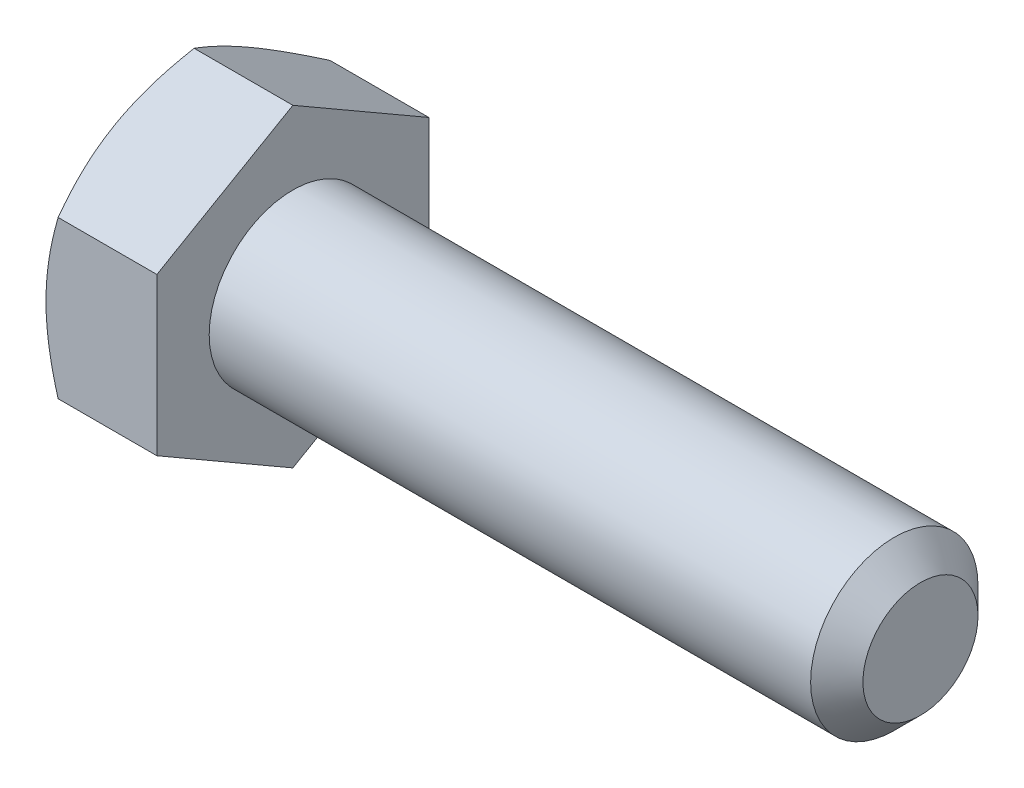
ISO-10303-21;
HEADER;
FILE_DESCRIPTION(('STEP AP214'),'2;1');
FILE_NAME('part.step','',(''),(''),'','','');
FILE_SCHEMA(('AUTOMOTIVE_DESIGN { 1 0 10303 214 1 1 1 1 }'));
ENDSEC;
DATA;
#1=APPLICATION_CONTEXT('core data for automotive mechanical design processes');
#2=APPLICATION_PROTOCOL_DEFINITION('international standard','automotive_design',2000,#1);
#3=PRODUCT_CONTEXT('',#1,'mechanical');
#4=PRODUCT('Part','Part','',(#3));
#5=PRODUCT_RELATED_PRODUCT_CATEGORY('part','',(#4));
#6=PRODUCT_DEFINITION_FORMATION('','',#4);
#7=PRODUCT_DEFINITION_CONTEXT('part definition',#1,'design');
#8=PRODUCT_DEFINITION('design','',#6,#7);
#9=PRODUCT_DEFINITION_SHAPE('','',#8);
#10=(LENGTH_UNIT() NAMED_UNIT(*) SI_UNIT(.MILLI.,.METRE.));
#11=(NAMED_UNIT(*) PLANE_ANGLE_UNIT() SI_UNIT($,.RADIAN.));
#12=(NAMED_UNIT(*) SI_UNIT($,.STERADIAN.) SOLID_ANGLE_UNIT());
#13=UNCERTAINTY_MEASURE_WITH_UNIT(LENGTH_MEASURE(1.E-05),#10,'distance_accuracy_value','');
#14=(GEOMETRIC_REPRESENTATION_CONTEXT(3) GLOBAL_UNCERTAINTY_ASSIGNED_CONTEXT((#13)) GLOBAL_UNIT_ASSIGNED_CONTEXT((#10,
#11,#12)) REPRESENTATION_CONTEXT('',''));
#15=CARTESIAN_POINT('',(0.,0.,0.));
#16=DIRECTION('',(0.,0.,1.));
#17=DIRECTION('',(1.,0.,0.));
#18=AXIS2_PLACEMENT_3D('',#15,#16,#17);
#19=CARTESIAN_POINT('',(30.,0.,0.));
#20=DIRECTION('',(-1.,0.,0.));
#21=DIRECTION('',(0.,0.,1.));
#22=AXIS2_PLACEMENT_3D('',#19,#20,#21);
#23=CYLINDRICAL_SURFACE('',#22,4.);
#24=CARTESIAN_POINT('',(28.75,0.,0.));
#25=DIRECTION('',(1.,0.,0.));
#26=DIRECTION('',(0.,0.,-1.));
#27=AXIS2_PLACEMENT_3D('',#24,#25,#26);
#28=CIRCLE('',#27,4.);
#29=CARTESIAN_POINT('',(28.75,0.,-4.));
#30=VERTEX_POINT('',#29);
#31=EDGE_CURVE('E11',#30,#30,#28,.F.);
#32=ORIENTED_EDGE('',*,*,#31,.T.);
#33=EDGE_LOOP('',(#32));
#34=FACE_BOUND('',#33,.T.);
#35=CARTESIAN_POINT('',(0.,0.,0.));
#36=DIRECTION('',(-1.,0.,0.));
#37=DIRECTION('',(0.,0.,1.));
#38=AXIS2_PLACEMENT_3D('',#35,#36,#37);
#39=CIRCLE('',#38,4.);
#40=CARTESIAN_POINT('',(0.,0.,4.));
#41=VERTEX_POINT('',#40);
#42=EDGE_CURVE('E537',#41,#41,#39,.T.);
#43=ORIENTED_EDGE('',*,*,#42,.F.);
#44=EDGE_LOOP('',(#43));
#45=FACE_BOUND('',#44,.T.);
#46=ADVANCED_FACE('F362',(#34,#45),#23,.T.);
#47=CARTESIAN_POINT('',(30.,0.,0.));
#48=DIRECTION('',(1.,0.,0.));
#49=DIRECTION('',(0.,0.,-1.));
#50=AXIS2_PLACEMENT_3D('',#47,#48,#49);
#51=PLANE('',#50);
#52=CARTESIAN_POINT('',(30.,0.,0.));
#53=DIRECTION('',(1.,0.,0.));
#54=DIRECTION('',(0.,0.,-1.));
#55=AXIS2_PLACEMENT_3D('',#52,#53,#54);
#56=CIRCLE('',#55,2.74999999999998);
#57=CARTESIAN_POINT('',(30.,0.,-2.74999999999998));
#58=VERTEX_POINT('',#57);
#59=EDGE_CURVE('E369',#58,#58,#56,.T.);
#60=ORIENTED_EDGE('',*,*,#59,.T.);
#61=EDGE_LOOP('',(#60));
#62=FACE_BOUND('',#61,.T.);
#63=ADVANCED_FACE('F522',(#62),#51,.T.);
#64=CARTESIAN_POINT('',(0.,-7.50555349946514,0.));
#65=DIRECTION('',(-1.,0.,0.));
#66=DIRECTION('',(0.,0.,1.));
#67=AXIS2_PLACEMENT_3D('',#64,#65,#66);
#68=PLANE('',#67);
#69=DIRECTION('',(0.,0.5,0.866025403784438));
#70=VECTOR('',#69,1.);
#71=CARTESIAN_POINT('',(0.,-7.50555349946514,0.));
#72=LINE('',#71,#70);
#73=CARTESIAN_POINT('',(0.,-7.50555349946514,0.));
#74=VERTEX_POINT('',#73);
#75=CARTESIAN_POINT('',(0.,-3.75277674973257,6.5));
#76=VERTEX_POINT('',#75);
#77=EDGE_CURVE('E564',#74,#76,#72,.T.);
#78=ORIENTED_EDGE('',*,*,#77,.F.);
#79=DIRECTION('',(0.,0.5,-0.866025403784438));
#80=VECTOR('',#79,1.);
#81=CARTESIAN_POINT('',(0.,-7.50555349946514,0.));
#82=LINE('',#81,#80);
#83=CARTESIAN_POINT('',(0.,-3.75277674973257,-6.5));
#84=VERTEX_POINT('',#83);
#85=EDGE_CURVE('E551',#74,#84,#82,.T.);
#86=ORIENTED_EDGE('',*,*,#85,.T.);
#87=DIRECTION('',(0.,1.,0.));
#88=VECTOR('',#87,1.);
#89=CARTESIAN_POINT('',(0.,-3.75277674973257,-6.5));
#90=LINE('',#89,#88);
#91=CARTESIAN_POINT('',(0.,3.75277674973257,-6.5));
#92=VERTEX_POINT('',#91);
#93=EDGE_CURVE('E554',#84,#92,#90,.T.);
#94=ORIENTED_EDGE('',*,*,#93,.T.);
#95=DIRECTION('',(0.,0.5,0.866025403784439));
#96=VECTOR('',#95,1.);
#97=CARTESIAN_POINT('',(0.,3.75277674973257,-6.5));
#98=LINE('',#97,#96);
#99=CARTESIAN_POINT('',(0.,7.50555349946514,0.));
#100=VERTEX_POINT('',#99);
#101=EDGE_CURVE('E557',#92,#100,#98,.T.);
#102=ORIENTED_EDGE('',*,*,#101,.T.);
#103=DIRECTION('',(0.,0.5,-0.866025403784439));
#104=VECTOR('',#103,1.);
#105=CARTESIAN_POINT('',(0.,3.75277674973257,6.5));
#106=LINE('',#105,#104);
#107=CARTESIAN_POINT('',(0.,3.75277674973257,6.5));
#108=VERTEX_POINT('',#107);
#109=EDGE_CURVE('E560',#108,#100,#106,.T.);
#110=ORIENTED_EDGE('',*,*,#109,.F.);
#111=DIRECTION('',(0.,1.,0.));
#112=VECTOR('',#111,1.);
#113=CARTESIAN_POINT('',(0.,-3.75277674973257,6.5));
#114=LINE('',#113,#112);
#115=EDGE_CURVE('E562',#76,#108,#114,.T.);
#116=ORIENTED_EDGE('',*,*,#115,.F.);
#117=EDGE_LOOP('',(#78,#86,#94,#102,#110,#116));
#118=FACE_BOUND('',#117,.T.);
#119=ORIENTED_EDGE('',*,*,#42,.T.);
#120=EDGE_LOOP('',(#119));
#121=FACE_BOUND('',#120,.T.);
#122=ADVANCED_FACE('F493',(#118,#121),#68,.F.);
#123=CARTESIAN_POINT('',(-5.3,-7.50555349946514,0.));
#124=DIRECTION('',(0.,0.866025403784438,-0.5));
#125=DIRECTION('',(0.,0.5,0.866025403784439));
#126=AXIS2_PLACEMENT_3D('',#123,#124,#125);
#127=PLANE('',#126);
#128=CARTESIAN_POINT('',(-4.71937674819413,-7.50566896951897,-0.000200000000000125));
#129=CARTESIAN_POINT('',(-4.76699557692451,-7.4231786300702,0.142677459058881));
#130=CARTESIAN_POINT('',(-4.81245329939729,-7.34038072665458,0.286087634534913));
#131=CARTESIAN_POINT('',(-4.89845131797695,-7.17411251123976,0.574072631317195));
#132=CARTESIAN_POINT('',(-4.93898949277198,-7.09064192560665,0.718647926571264));
#133=CARTESIAN_POINT('',(-5.05242899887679,-6.83889369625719,1.15468865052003));
#134=CARTESIAN_POINT('',(-5.11695219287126,-6.66962231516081,1.44787528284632));
#135=CARTESIAN_POINT('',(-5.19261341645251,-6.41631077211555,1.88662374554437));
#136=CARTESIAN_POINT('',(-5.21416714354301,-6.33302748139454,2.03087463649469));
#137=CARTESIAN_POINT('',(-5.25030968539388,-6.16608458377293,2.32002821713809));
#138=CARTESIAN_POINT('',(-5.26489911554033,-6.08242501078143,2.46493084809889));
#139=CARTESIAN_POINT('',(-5.28674124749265,-5.91496056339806,2.75498777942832));
#140=CARTESIAN_POINT('',(-5.29400227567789,-5.8311559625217,2.90014160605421));
#141=CARTESIAN_POINT('',(-5.30103969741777,-5.66347396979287,3.19057533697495));
#142=CARTESIAN_POINT('',(-5.3008163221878,-5.5795965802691,3.33585523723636));
#143=CARTESIAN_POINT('',(-5.28991654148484,-5.34979921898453,3.73387594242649));
#144=CARTESIAN_POINT('',(-5.27161818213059,-5.20395446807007,3.98648646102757));
#145=CARTESIAN_POINT('',(-5.21359365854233,-4.91323365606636,4.49002967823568));
#146=CARTESIAN_POINT('',(-5.17384766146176,-4.76835861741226,4.74096060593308));
#147=CARTESIAN_POINT('',(-5.07449409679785,-4.47705272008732,5.24551722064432));
#148=CARTESIAN_POINT('',(-5.01446557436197,-4.33065861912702,5.49907924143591));
#149=CARTESIAN_POINT('',(-4.87822500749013,-4.04005357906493,6.00242193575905));
#150=CARTESIAN_POINT('',(-4.80204496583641,-3.89583891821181,6.25220905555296));
#151=CARTESIAN_POINT('',(-4.71937674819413,-3.75266127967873,6.5002));
#152=B_SPLINE_CURVE_WITH_KNOTS('',3,(#128,#129,#130,#131,#132,#133,#134,#135,#136,#137,#138,
#139,#140,#141,#142,#143,#144,#145,#146,#147,#148,#149,#150,#151),.UNSPECIFIED.,.F.,.F.,(4,2,2,
2,2,2,2,2,2,2,2,4),(0.,0.515105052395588,1.03043143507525,2.06322554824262,2.56697389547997,
3.07067772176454,3.57380860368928,4.0769239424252,4.9527935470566,5.82947446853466,
6.72559912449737,7.61996451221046),.UNSPECIFIED.);
#153=CARTESIAN_POINT('',(-4.71944341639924,-7.50555349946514,0.));
#154=VERTEX_POINT('',#153);
#155=CARTESIAN_POINT('',(-5.3,-5.62916512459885,3.25));
#156=VERTEX_POINT('',#155);
#157=EDGE_CURVE('E510',#154,#156,#152,.T.);
#158=ORIENTED_EDGE('',*,*,#157,.F.);
#159=DIRECTION('',(1.,0.,0.));
#160=VECTOR('',#159,1.);
#161=CARTESIAN_POINT('',(-5.3,-7.50555349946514,0.));
#162=LINE('',#161,#160);
#163=EDGE_CURVE('E549',#154,#74,#162,.T.);
#164=ORIENTED_EDGE('',*,*,#163,.T.);
#165=ORIENTED_EDGE('',*,*,#77,.T.);
#166=DIRECTION('',(1.,0.,0.));
#167=VECTOR('',#166,1.);
#168=CARTESIAN_POINT('',(-5.3,-3.75277674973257,6.5));
#169=LINE('',#168,#167);
#170=CARTESIAN_POINT('',(-4.71944341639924,-3.75277674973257,6.5));
#171=VERTEX_POINT('',#170);
#172=EDGE_CURVE('E540',#171,#76,#169,.T.);
#173=ORIENTED_EDGE('',*,*,#172,.F.);
#174=EDGE_CURVE('E464',#156,#171,#152,.T.);
#175=ORIENTED_EDGE('',*,*,#174,.F.);
#176=EDGE_LOOP('',(#158,#164,#165,#173,#175));
#177=FACE_BOUND('',#176,.T.);
#178=ADVANCED_FACE('F516',(#177),#127,.F.);
#179=CARTESIAN_POINT('',(-5.3,-3.75277674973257,6.5));
#180=DIRECTION('',(0.,0.,-1.));
#181=DIRECTION('',(-1.,0.,0.));
#182=AXIS2_PLACEMENT_3D('',#179,#180,#181);
#183=PLANE('',#182);
#184=CARTESIAN_POINT('',(-2.0488375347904,-10.2428264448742,6.5));
#185=CARTESIAN_POINT('',(-2.18789595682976,-9.95749123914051,6.5));
#186=CARTESIAN_POINT('',(-2.32566707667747,-9.67151814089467,6.5));
#187=CARTESIAN_POINT('',(-2.59791370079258,-9.09795746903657,6.5));
#188=CARTESIAN_POINT('',(-2.73238871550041,-8.81036966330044,6.5));
#189=CARTESIAN_POINT('',(-2.99796413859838,-8.23183597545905,6.5));
#190=CARTESIAN_POINT('',(-3.12904355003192,-7.94088042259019,6.5));
#191=CARTESIAN_POINT('',(-3.38604980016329,-7.35671087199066,6.5));
#192=CARTESIAN_POINT('',(-3.51197687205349,-7.06349697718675,6.5));
#193=CARTESIAN_POINT('',(-3.76148583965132,-6.4643492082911,6.5));
#194=CARTESIAN_POINT('',(-3.88484316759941,-6.15832132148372,6.5));
#195=CARTESIAN_POINT('',(-4.122608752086,-5.54274557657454,6.5));
#196=CARTESIAN_POINT('',(-4.23701602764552,-5.23319733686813,6.5));
#197=CARTESIAN_POINT('',(-4.45399730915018,-4.61061796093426,6.5));
#198=CARTESIAN_POINT('',(-4.55659391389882,-4.29759477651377,6.5));
#199=CARTESIAN_POINT('',(-4.7467687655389,-3.66705774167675,6.5));
#200=CARTESIAN_POINT('',(-4.83435157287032,-3.34954528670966,6.5));
#201=CARTESIAN_POINT('',(-4.98994277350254,-2.7116231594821,6.5));
#202=CARTESIAN_POINT('',(-5.05806094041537,-2.39124068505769,6.5));
#203=CARTESIAN_POINT('',(-5.17096432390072,-1.74628166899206,6.5));
#204=CARTESIAN_POINT('',(-5.21575208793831,-1.42170558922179,6.5));
#205=CARTESIAN_POINT('',(-5.26247031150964,-0.935153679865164,6.5));
#206=CARTESIAN_POINT('',(-5.27461755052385,-0.774120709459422,6.5));
#207=CARTESIAN_POINT('',(-5.29209027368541,-0.451677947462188,6.5));
#208=CARTESIAN_POINT('',(-5.29741587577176,-0.290268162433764,6.5));
#209=CARTESIAN_POINT('',(-5.30111032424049,0.0326315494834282,6.5));
#210=CARTESIAN_POINT('',(-5.29947913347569,0.194121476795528,6.5));
#211=CARTESIAN_POINT('',(-5.28930353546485,0.516885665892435,6.5));
#212=CARTESIAN_POINT('',(-5.2807588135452,0.678159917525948,6.5));
#213=CARTESIAN_POINT('',(-5.2524625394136,1.06087214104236,6.5));
#214=CARTESIAN_POINT('',(-5.22970222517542,1.28209274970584,6.5));
#215=CARTESIAN_POINT('',(-5.17237790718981,1.72298724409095,6.5));
#216=CARTESIAN_POINT('',(-5.13781243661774,1.94266093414,6.5));
#217=CARTESIAN_POINT('',(-5.01823337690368,2.59905068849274,6.5));
#218=CARTESIAN_POINT('',(-4.91735524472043,3.03292018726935,6.5));
#219=CARTESIAN_POINT('',(-4.74117763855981,3.68203059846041,6.5));
#220=CARTESIAN_POINT('',(-4.67743243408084,3.90060192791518,6.5));
#221=CARTESIAN_POINT('',(-4.54301317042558,4.33562456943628,6.5));
#222=CARTESIAN_POINT('',(-4.47233905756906,4.55207586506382,6.5));
#223=CARTESIAN_POINT('',(-4.32522134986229,4.9829231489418,6.5));
#224=CARTESIAN_POINT('',(-4.24877936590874,5.19731969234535,6.5));
#225=CARTESIAN_POINT('',(-4.09105605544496,5.62431367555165,6.5));
#226=CARTESIAN_POINT('',(-4.00977484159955,5.83691115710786,6.5));
#227=CARTESIAN_POINT('',(-3.78396124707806,6.41107024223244,6.5));
#228=CARTESIAN_POINT('',(-3.63553740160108,6.7710999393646,6.5));
#229=CARTESIAN_POINT('',(-3.3299136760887,7.4874289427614,6.5));
#230=CARTESIAN_POINT('',(-3.17271280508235,7.84372782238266,6.5));
#231=CARTESIAN_POINT('',(-2.8516207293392,8.55345570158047,6.5));
#232=CARTESIAN_POINT('',(-2.68772693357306,8.90688352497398,6.5));
#233=CARTESIAN_POINT('',(-2.35485675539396,9.61131133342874,6.5));
#234=CARTESIAN_POINT('',(-2.18588058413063,9.96231141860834,6.5));
#235=CARTESIAN_POINT('',(-1.84367823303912,10.662937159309,6.5));
#236=CARTESIAN_POINT('',(-1.67044558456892,11.012559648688,6.5));
#237=CARTESIAN_POINT('',(-1.32082260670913,11.7102232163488,6.5));
#238=CARTESIAN_POINT('',(-1.14443225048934,12.0582642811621,6.5));
#239=CARTESIAN_POINT('',(-0.78915631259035,12.7529700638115,6.5));
#240=CARTESIAN_POINT('',(-0.610271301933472,13.099635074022,6.5));
#241=CARTESIAN_POINT('',(-0.250435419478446,13.7918918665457,6.5));
#242=CARTESIAN_POINT('',(-0.0694845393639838,14.1374836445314,6.5));
#243=CARTESIAN_POINT('',(0.437179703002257,15.099399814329,6.5));
#244=CARTESIAN_POINT('',(0.7647482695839,15.7147468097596,6.5));
#245=CARTESIAN_POINT('',(1.4238123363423,16.9433793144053,6.5));
#246=CARTESIAN_POINT('',(1.75530808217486,17.5566646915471,6.5));
#247=CARTESIAN_POINT('',(2.42008717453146,18.779571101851,6.5));
#248=CARTESIAN_POINT('',(2.75336064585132,19.3891975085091,6.5));
#249=CARTESIAN_POINT('',(3.4221398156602,20.6071616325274,6.5));
#250=CARTESIAN_POINT('',(3.75764533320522,21.2154994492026,6.5));
#251=CARTESIAN_POINT('',(4.0939612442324,21.8233856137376,6.5));
#252=B_SPLINE_CURVE_WITH_KNOTS('',3,(#184,#185,#186,#187,#188,#189,#190,#191,#192,#193,#194,
#195,#196,#197,#198,#199,#200,#201,#202,#203,#204,#205,#206,#207,#208,#209,#210,#211,#212,#213,
#214,#215,#216,#217,#218,#219,#220,#221,#222,#223,#224,#225,#226,#227,#228,#229,#230,#231,#232,
#233,#234,#235,#236,#237,#238,#239,#240,#241,#242,#243,#244,#245,#246,#247,#248,#249,#250,#251),
.UNSPECIFIED.,.F.,.F.,(4,2,2,2,2,2,2,2,2,2,2,2,2,2,2,2,2,2,2,2,2,2,2,2,2,2,2,2,2,2,2,2,2,4),(0.,
0.952261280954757,1.90466315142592,2.86198011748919,3.81925370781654,4.80900961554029,
5.79887385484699,6.78681142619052,7.77444837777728,8.75640022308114,9.73824482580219,
10.2225937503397,10.7069343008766,11.1912774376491,11.6756426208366,12.3424346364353,
13.0093095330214,14.3437044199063,15.0266742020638,15.7096492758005,16.3924343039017,
17.0752034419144,18.2433007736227,19.4115302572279,20.580216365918,21.7488539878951,
22.9193933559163,24.0899426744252,25.2602283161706,26.4305186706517,28.5218066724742,
30.6132261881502,32.6975528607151,34.7817125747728),.UNSPECIFIED.);
#253=CARTESIAN_POINT('',(-5.3,0.,6.5));
#254=VERTEX_POINT('',#253);
#255=EDGE_CURVE('E566',#171,#254,#252,.T.);
#256=ORIENTED_EDGE('',*,*,#255,.F.);
#257=ORIENTED_EDGE('',*,*,#172,.T.);
#258=ORIENTED_EDGE('',*,*,#115,.T.);
#259=DIRECTION('',(1.,0.,0.));
#260=VECTOR('',#259,1.);
#261=CARTESIAN_POINT('',(-5.3,3.75277674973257,6.5));
#262=LINE('',#261,#260);
#263=CARTESIAN_POINT('',(-4.71944341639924,3.75277674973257,6.5));
#264=VERTEX_POINT('',#263);
#265=EDGE_CURVE('E542',#264,#108,#262,.T.);
#266=ORIENTED_EDGE('',*,*,#265,.F.);
#267=EDGE_CURVE('E435',#254,#264,#252,.T.);
#268=ORIENTED_EDGE('',*,*,#267,.F.);
#269=EDGE_LOOP('',(#256,#257,#258,#266,#268));
#270=FACE_BOUND('',#269,.T.);
#271=ADVANCED_FACE('F519',(#270),#183,.F.);
#272=CARTESIAN_POINT('',(-5.3,3.75277674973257,6.5));
#273=DIRECTION('',(0.,-0.866025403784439,-0.5));
#274=DIRECTION('',(0.,0.5,-0.866025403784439));
#275=AXIS2_PLACEMENT_3D('',#272,#273,#274);
#276=PLANE('',#275);
#277=CARTESIAN_POINT('',(-4.71937674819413,3.75266127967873,6.5002));
#278=CARTESIAN_POINT('',(-4.76699557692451,3.83515161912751,6.35732254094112));
#279=CARTESIAN_POINT('',(-4.81245329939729,3.91794952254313,6.21391236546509));
#280=CARTESIAN_POINT('',(-4.89845131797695,4.08421773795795,5.9259273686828));
#281=CARTESIAN_POINT('',(-4.93898949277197,4.16768832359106,5.78135207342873));
#282=CARTESIAN_POINT('',(-5.05242899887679,4.41943655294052,5.34531134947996));
#283=CARTESIAN_POINT('',(-5.11695219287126,4.5887079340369,5.05212471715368));
#284=CARTESIAN_POINT('',(-5.19261341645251,4.84201947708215,4.61337625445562));
#285=CARTESIAN_POINT('',(-5.21416714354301,4.92530276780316,4.46912536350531));
#286=CARTESIAN_POINT('',(-5.25030968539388,5.09224566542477,4.17997178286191));
#287=CARTESIAN_POINT('',(-5.26489911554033,5.17590523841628,4.03506915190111));
#288=CARTESIAN_POINT('',(-5.28674124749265,5.34336968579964,3.74501222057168));
#289=CARTESIAN_POINT('',(-5.29400227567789,5.427174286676,3.59985839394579));
#290=CARTESIAN_POINT('',(-5.30103969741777,5.59485627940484,3.30942466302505));
#291=CARTESIAN_POINT('',(-5.30081632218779,5.6787336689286,3.16414476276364));
#292=CARTESIAN_POINT('',(-5.28991654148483,5.90853103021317,2.7661240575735));
#293=CARTESIAN_POINT('',(-5.27161818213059,6.05437578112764,2.51351353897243));
#294=CARTESIAN_POINT('',(-5.21359365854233,6.34509659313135,2.00997032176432));
#295=CARTESIAN_POINT('',(-5.17384766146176,6.48997163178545,1.75903939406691));
#296=CARTESIAN_POINT('',(-5.07449409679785,6.78127752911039,1.25448277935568));
#297=CARTESIAN_POINT('',(-5.01446557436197,6.92767163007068,1.00092075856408));
#298=CARTESIAN_POINT('',(-4.87822500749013,7.21827667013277,0.497578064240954));
#299=CARTESIAN_POINT('',(-4.80204496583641,7.36249133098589,0.247790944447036));
#300=CARTESIAN_POINT('',(-4.71937674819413,7.50566896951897,-0.000199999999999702));
#301=B_SPLINE_CURVE_WITH_KNOTS('',3,(#277,#278,#279,#280,#281,#282,#283,#284,#285,#286,#287,
#288,#289,#290,#291,#292,#293,#294,#295,#296,#297,#298,#299,#300),.UNSPECIFIED.,.F.,.F.,(4,2,2,
2,2,2,2,2,2,2,2,4),(0.,0.515105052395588,1.03043143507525,2.06322554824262,2.56697389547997,
3.07067772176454,3.57380860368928,4.0769239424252,4.9527935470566,5.82947446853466,
6.72559912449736,7.61996451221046),.UNSPECIFIED.);
#302=CARTESIAN_POINT('',(-5.3,5.62916512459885,3.25));
#303=VERTEX_POINT('',#302);
#304=EDGE_CURVE('E431',#264,#303,#301,.T.);
#305=ORIENTED_EDGE('',*,*,#304,.F.);
#306=ORIENTED_EDGE('',*,*,#265,.T.);
#307=ORIENTED_EDGE('',*,*,#109,.T.);
#308=DIRECTION('',(1.,0.,0.));
#309=VECTOR('',#308,1.);
#310=CARTESIAN_POINT('',(-5.3,7.50555349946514,0.));
#311=LINE('',#310,#309);
#312=CARTESIAN_POINT('',(-4.71944341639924,7.50555349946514,0.));
#313=VERTEX_POINT('',#312);
#314=EDGE_CURVE('E463',#313,#100,#311,.T.);
#315=ORIENTED_EDGE('',*,*,#314,.F.);
#316=EDGE_CURVE('E439',#303,#313,#301,.T.);
#317=ORIENTED_EDGE('',*,*,#316,.F.);
#318=EDGE_LOOP('',(#305,#306,#307,#315,#317));
#319=FACE_BOUND('',#318,.T.);
#320=ADVANCED_FACE('F461',(#319),#276,.F.);
#321=CARTESIAN_POINT('',(-5.3,3.75277674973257,-6.5));
#322=DIRECTION('',(0.,0.866025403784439,-0.5));
#323=DIRECTION('',(0.,0.5,0.866025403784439));
#324=AXIS2_PLACEMENT_3D('',#321,#322,#323);
#325=PLANE('',#324);
#326=DIRECTION('',(1.,0.,0.));
#327=VECTOR('',#326,1.);
#328=CARTESIAN_POINT('',(-5.3,3.75277674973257,-6.5));
#329=LINE('',#328,#327);
#330=CARTESIAN_POINT('',(-4.71944341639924,3.75277674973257,-6.5));
#331=VERTEX_POINT('',#330);
#332=EDGE_CURVE('E545',#331,#92,#329,.T.);
#333=ORIENTED_EDGE('',*,*,#332,.F.);
#334=CARTESIAN_POINT('',(-4.71937674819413,3.75266127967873,-6.5002));
#335=CARTESIAN_POINT('',(-4.76699557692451,3.83515161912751,-6.35732254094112));
#336=CARTESIAN_POINT('',(-4.81245329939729,3.91794952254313,-6.21391236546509));
#337=CARTESIAN_POINT('',(-4.89845131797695,4.08421773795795,-5.9259273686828));
#338=CARTESIAN_POINT('',(-4.93898949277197,4.16768832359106,-5.78135207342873));
#339=CARTESIAN_POINT('',(-5.05242899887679,4.41943655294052,-5.34531134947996));
#340=CARTESIAN_POINT('',(-5.11695219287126,4.5887079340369,-5.05212471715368));
#341=CARTESIAN_POINT('',(-5.19261341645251,4.84201947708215,-4.61337625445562));
#342=CARTESIAN_POINT('',(-5.21416714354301,4.92530276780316,-4.46912536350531));
#343=CARTESIAN_POINT('',(-5.25030968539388,5.09224566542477,-4.17997178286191));
#344=CARTESIAN_POINT('',(-5.26489911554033,5.17590523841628,-4.03506915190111));
#345=CARTESIAN_POINT('',(-5.28674124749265,5.34336968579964,-3.74501222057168));
#346=CARTESIAN_POINT('',(-5.29400227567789,5.427174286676,-3.59985839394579));
#347=CARTESIAN_POINT('',(-5.30103969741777,5.59485627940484,-3.30942466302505));
#348=CARTESIAN_POINT('',(-5.30081632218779,5.6787336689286,-3.16414476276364));
#349=CARTESIAN_POINT('',(-5.28991654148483,5.90853103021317,-2.7661240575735));
#350=CARTESIAN_POINT('',(-5.27161818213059,6.05437578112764,-2.51351353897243));
#351=CARTESIAN_POINT('',(-5.21359365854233,6.34509659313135,-2.00997032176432));
#352=CARTESIAN_POINT('',(-5.17384766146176,6.48997163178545,-1.75903939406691));
#353=CARTESIAN_POINT('',(-5.07449409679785,6.78127752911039,-1.25448277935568));
#354=CARTESIAN_POINT('',(-5.01446557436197,6.92767163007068,-1.00092075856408));
#355=CARTESIAN_POINT('',(-4.87822500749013,7.21827667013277,-0.497578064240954));
#356=CARTESIAN_POINT('',(-4.80204496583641,7.36249133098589,-0.247790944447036));
#357=CARTESIAN_POINT('',(-4.71937674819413,7.50566896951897,0.000199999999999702));
#358=B_SPLINE_CURVE_WITH_KNOTS('',3,(#334,#335,#336,#337,#338,#339,#340,#341,#342,#343,#344,
#345,#346,#347,#348,#349,#350,#351,#352,#353,#354,#355,#356,#357),.UNSPECIFIED.,.F.,.F.,(4,2,2,
2,2,2,2,2,2,2,2,4),(0.,0.515105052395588,1.03043143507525,2.06322554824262,2.56697389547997,
3.07067772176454,3.57380860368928,4.0769239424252,4.9527935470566,5.82947446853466,
6.72559912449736,7.61996451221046),.UNSPECIFIED.);
#359=CARTESIAN_POINT('',(-5.3,5.62916512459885,-3.25));
#360=VERTEX_POINT('',#359);
#361=EDGE_CURVE('E466',#331,#360,#358,.T.);
#362=ORIENTED_EDGE('',*,*,#361,.T.);
#363=EDGE_CURVE('E446',#360,#313,#358,.T.);
#364=ORIENTED_EDGE('',*,*,#363,.T.);
#365=ORIENTED_EDGE('',*,*,#314,.T.);
#366=ORIENTED_EDGE('',*,*,#101,.F.);
#367=EDGE_LOOP('',(#333,#362,#364,#365,#366));
#368=FACE_BOUND('',#367,.T.);
#369=ADVANCED_FACE('F592',(#368),#325,.T.);
#370=CARTESIAN_POINT('',(-5.3,-3.75277674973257,-6.5));
#371=DIRECTION('',(0.,0.,-1.));
#372=DIRECTION('',(-1.,0.,0.));
#373=AXIS2_PLACEMENT_3D('',#370,#371,#372);
#374=PLANE('',#373);
#375=DIRECTION('',(1.,0.,0.));
#376=VECTOR('',#375,1.);
#377=CARTESIAN_POINT('',(-5.3,-3.75277674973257,-6.5));
#378=LINE('',#377,#376);
#379=CARTESIAN_POINT('',(-4.71944341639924,-3.75277674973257,-6.5));
#380=VERTEX_POINT('',#379);
#381=EDGE_CURVE('E547',#380,#84,#378,.T.);
#382=ORIENTED_EDGE('',*,*,#381,.F.);
#383=CARTESIAN_POINT('',(-2.0488375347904,-10.2428264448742,-6.5));
#384=CARTESIAN_POINT('',(-2.18789595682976,-9.95749123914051,-6.5));
#385=CARTESIAN_POINT('',(-2.32566707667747,-9.67151814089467,-6.5));
#386=CARTESIAN_POINT('',(-2.59791370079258,-9.09795746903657,-6.5));
#387=CARTESIAN_POINT('',(-2.73238871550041,-8.81036966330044,-6.5));
#388=CARTESIAN_POINT('',(-2.99796413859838,-8.23183597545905,-6.5));
#389=CARTESIAN_POINT('',(-3.12904355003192,-7.94088042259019,-6.5));
#390=CARTESIAN_POINT('',(-3.38604980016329,-7.35671087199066,-6.5));
#391=CARTESIAN_POINT('',(-3.51197687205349,-7.06349697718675,-6.5));
#392=CARTESIAN_POINT('',(-3.76148583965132,-6.4643492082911,-6.5));
#393=CARTESIAN_POINT('',(-3.88484316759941,-6.15832132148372,-6.5));
#394=CARTESIAN_POINT('',(-4.122608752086,-5.54274557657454,-6.5));
#395=CARTESIAN_POINT('',(-4.23701602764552,-5.23319733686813,-6.5));
#396=CARTESIAN_POINT('',(-4.45399730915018,-4.61061796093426,-6.5));
#397=CARTESIAN_POINT('',(-4.55659391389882,-4.29759477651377,-6.5));
#398=CARTESIAN_POINT('',(-4.7467687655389,-3.66705774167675,-6.5));
#399=CARTESIAN_POINT('',(-4.83435157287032,-3.34954528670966,-6.5));
#400=CARTESIAN_POINT('',(-4.98994277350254,-2.7116231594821,-6.5));
#401=CARTESIAN_POINT('',(-5.05806094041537,-2.39124068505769,-6.5));
#402=CARTESIAN_POINT('',(-5.17096432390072,-1.74628166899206,-6.5));
#403=CARTESIAN_POINT('',(-5.21575208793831,-1.42170558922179,-6.5));
#404=CARTESIAN_POINT('',(-5.26247031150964,-0.935153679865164,-6.5));
#405=CARTESIAN_POINT('',(-5.27461755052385,-0.774120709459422,-6.5));
#406=CARTESIAN_POINT('',(-5.29209027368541,-0.451677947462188,-6.5));
#407=CARTESIAN_POINT('',(-5.29741587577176,-0.290268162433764,-6.5));
#408=CARTESIAN_POINT('',(-5.30111032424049,0.0326315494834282,-6.5));
#409=CARTESIAN_POINT('',(-5.29947913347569,0.194121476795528,-6.5));
#410=CARTESIAN_POINT('',(-5.28930353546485,0.516885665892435,-6.5));
#411=CARTESIAN_POINT('',(-5.2807588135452,0.678159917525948,-6.5));
#412=CARTESIAN_POINT('',(-5.2524625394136,1.06087214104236,-6.5));
#413=CARTESIAN_POINT('',(-5.22970222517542,1.28209274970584,-6.5));
#414=CARTESIAN_POINT('',(-5.17237790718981,1.72298724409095,-6.5));
#415=CARTESIAN_POINT('',(-5.13781243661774,1.94266093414,-6.5));
#416=CARTESIAN_POINT('',(-5.01823337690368,2.59905068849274,-6.5));
#417=CARTESIAN_POINT('',(-4.91735524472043,3.03292018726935,-6.5));
#418=CARTESIAN_POINT('',(-4.74117763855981,3.68203059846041,-6.5));
#419=CARTESIAN_POINT('',(-4.67743243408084,3.90060192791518,-6.5));
#420=CARTESIAN_POINT('',(-4.54301317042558,4.33562456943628,-6.5));
#421=CARTESIAN_POINT('',(-4.47233905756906,4.55207586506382,-6.5));
#422=CARTESIAN_POINT('',(-4.32522134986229,4.9829231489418,-6.5));
#423=CARTESIAN_POINT('',(-4.24877936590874,5.19731969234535,-6.5));
#424=CARTESIAN_POINT('',(-4.09105605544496,5.62431367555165,-6.5));
#425=CARTESIAN_POINT('',(-4.00977484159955,5.83691115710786,-6.5));
#426=CARTESIAN_POINT('',(-3.78396124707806,6.41107024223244,-6.5));
#427=CARTESIAN_POINT('',(-3.63553740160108,6.7710999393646,-6.5));
#428=CARTESIAN_POINT('',(-3.3299136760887,7.4874289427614,-6.5));
#429=CARTESIAN_POINT('',(-3.17271280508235,7.84372782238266,-6.5));
#430=CARTESIAN_POINT('',(-2.8516207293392,8.55345570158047,-6.5));
#431=CARTESIAN_POINT('',(-2.68772693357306,8.90688352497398,-6.5));
#432=CARTESIAN_POINT('',(-2.35485675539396,9.61131133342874,-6.5));
#433=CARTESIAN_POINT('',(-2.18588058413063,9.96231141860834,-6.5));
#434=CARTESIAN_POINT('',(-1.84367823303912,10.662937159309,-6.5));
#435=CARTESIAN_POINT('',(-1.67044558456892,11.012559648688,-6.5));
#436=CARTESIAN_POINT('',(-1.32082260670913,11.7102232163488,-6.5));
#437=CARTESIAN_POINT('',(-1.14443225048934,12.0582642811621,-6.5));
#438=CARTESIAN_POINT('',(-0.78915631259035,12.7529700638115,-6.5));
#439=CARTESIAN_POINT('',(-0.610271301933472,13.099635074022,-6.5));
#440=CARTESIAN_POINT('',(-0.250435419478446,13.7918918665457,-6.5));
#441=CARTESIAN_POINT('',(-0.0694845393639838,14.1374836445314,-6.5));
#442=CARTESIAN_POINT('',(0.437179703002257,15.099399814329,-6.5));
#443=CARTESIAN_POINT('',(0.7647482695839,15.7147468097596,-6.5));
#444=CARTESIAN_POINT('',(1.4238123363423,16.9433793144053,-6.5));
#445=CARTESIAN_POINT('',(1.75530808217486,17.5566646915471,-6.5));
#446=CARTESIAN_POINT('',(2.42008717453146,18.779571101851,-6.5));
#447=CARTESIAN_POINT('',(2.75336064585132,19.3891975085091,-6.5));
#448=CARTESIAN_POINT('',(3.4221398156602,20.6071616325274,-6.5));
#449=CARTESIAN_POINT('',(3.75764533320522,21.2154994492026,-6.5));
#450=CARTESIAN_POINT('',(4.0939612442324,21.8233856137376,-6.5));
#451=B_SPLINE_CURVE_WITH_KNOTS('',3,(#383,#384,#385,#386,#387,#388,#389,#390,#391,#392,#393,
#394,#395,#396,#397,#398,#399,#400,#401,#402,#403,#404,#405,#406,#407,#408,#409,#410,#411,#412,
#413,#414,#415,#416,#417,#418,#419,#420,#421,#422,#423,#424,#425,#426,#427,#428,#429,#430,#431,
#432,#433,#434,#435,#436,#437,#438,#439,#440,#441,#442,#443,#444,#445,#446,#447,#448,#449,#450),
.UNSPECIFIED.,.F.,.F.,(4,2,2,2,2,2,2,2,2,2,2,2,2,2,2,2,2,2,2,2,2,2,2,2,2,2,2,2,2,2,2,2,2,4),(0.,
0.952261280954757,1.90466315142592,2.86198011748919,3.81925370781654,4.80900961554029,
5.79887385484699,6.78681142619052,7.77444837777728,8.75640022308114,9.73824482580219,
10.2225937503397,10.7069343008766,11.1912774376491,11.6756426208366,12.3424346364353,
13.0093095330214,14.3437044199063,15.0266742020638,15.7096492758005,16.3924343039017,
17.0752034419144,18.2433007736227,19.4115302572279,20.580216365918,21.7488539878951,
22.9193933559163,24.0899426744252,25.2602283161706,26.4305186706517,28.5218066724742,
30.6132261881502,32.6975528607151,34.7817125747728),.UNSPECIFIED.);
#452=CARTESIAN_POINT('',(-5.3,0.,-6.5));
#453=VERTEX_POINT('',#452);
#454=EDGE_CURVE('E384',#380,#453,#451,.T.);
#455=ORIENTED_EDGE('',*,*,#454,.T.);
#456=EDGE_CURVE('E515',#453,#331,#451,.T.);
#457=ORIENTED_EDGE('',*,*,#456,.T.);
#458=ORIENTED_EDGE('',*,*,#332,.T.);
#459=ORIENTED_EDGE('',*,*,#93,.F.);
#460=EDGE_LOOP('',(#382,#455,#457,#458,#459));
#461=FACE_BOUND('',#460,.T.);
#462=ADVANCED_FACE('F588',(#461),#374,.T.);
#463=CARTESIAN_POINT('',(-5.3,-7.50555349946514,0.));
#464=DIRECTION('',(0.,-0.866025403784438,-0.5));
#465=DIRECTION('',(0.,0.5,-0.866025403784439));
#466=AXIS2_PLACEMENT_3D('',#463,#464,#465);
#467=PLANE('',#466);
#468=ORIENTED_EDGE('',*,*,#163,.F.);
#469=CARTESIAN_POINT('',(-4.71937674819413,-7.50566896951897,0.000200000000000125));
#470=CARTESIAN_POINT('',(-4.76699557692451,-7.4231786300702,-0.142677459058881));
#471=CARTESIAN_POINT('',(-4.81245329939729,-7.34038072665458,-0.286087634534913));
#472=CARTESIAN_POINT('',(-4.89845131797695,-7.17411251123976,-0.574072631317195));
#473=CARTESIAN_POINT('',(-4.93898949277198,-7.09064192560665,-0.718647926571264));
#474=CARTESIAN_POINT('',(-5.05242899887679,-6.83889369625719,-1.15468865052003));
#475=CARTESIAN_POINT('',(-5.11695219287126,-6.66962231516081,-1.44787528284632));
#476=CARTESIAN_POINT('',(-5.19261341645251,-6.41631077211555,-1.88662374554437));
#477=CARTESIAN_POINT('',(-5.21416714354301,-6.33302748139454,-2.03087463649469));
#478=CARTESIAN_POINT('',(-5.25030968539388,-6.16608458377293,-2.32002821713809));
#479=CARTESIAN_POINT('',(-5.26489911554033,-6.08242501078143,-2.46493084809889));
#480=CARTESIAN_POINT('',(-5.28674124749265,-5.91496056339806,-2.75498777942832));
#481=CARTESIAN_POINT('',(-5.29400227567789,-5.8311559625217,-2.90014160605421));
#482=CARTESIAN_POINT('',(-5.30103969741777,-5.66347396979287,-3.19057533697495));
#483=CARTESIAN_POINT('',(-5.3008163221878,-5.5795965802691,-3.33585523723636));
#484=CARTESIAN_POINT('',(-5.28991654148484,-5.34979921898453,-3.73387594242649));
#485=CARTESIAN_POINT('',(-5.27161818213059,-5.20395446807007,-3.98648646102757));
#486=CARTESIAN_POINT('',(-5.21359365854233,-4.91323365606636,-4.49002967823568));
#487=CARTESIAN_POINT('',(-5.17384766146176,-4.76835861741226,-4.74096060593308));
#488=CARTESIAN_POINT('',(-5.07449409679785,-4.47705272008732,-5.24551722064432));
#489=CARTESIAN_POINT('',(-5.01446557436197,-4.33065861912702,-5.49907924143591));
#490=CARTESIAN_POINT('',(-4.87822500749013,-4.04005357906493,-6.00242193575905));
#491=CARTESIAN_POINT('',(-4.80204496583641,-3.89583891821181,-6.25220905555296));
#492=CARTESIAN_POINT('',(-4.71937674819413,-3.75266127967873,-6.5002));
#493=B_SPLINE_CURVE_WITH_KNOTS('',3,(#469,#470,#471,#472,#473,#474,#475,#476,#477,#478,#479,
#480,#481,#482,#483,#484,#485,#486,#487,#488,#489,#490,#491,#492),.UNSPECIFIED.,.F.,.F.,(4,2,2,
2,2,2,2,2,2,2,2,4),(0.,0.515105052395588,1.03043143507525,2.06322554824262,2.56697389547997,
3.07067772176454,3.57380860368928,4.0769239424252,4.9527935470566,5.82947446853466,
6.72559912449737,7.61996451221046),.UNSPECIFIED.);
#494=CARTESIAN_POINT('',(-5.3,-5.62916512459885,-3.25));
#495=VERTEX_POINT('',#494);
#496=EDGE_CURVE('E580',#154,#495,#493,.T.);
#497=ORIENTED_EDGE('',*,*,#496,.T.);
#498=EDGE_CURVE('E458',#495,#380,#493,.T.);
#499=ORIENTED_EDGE('',*,*,#498,.T.);
#500=ORIENTED_EDGE('',*,*,#381,.T.);
#501=ORIENTED_EDGE('',*,*,#85,.F.);
#502=EDGE_LOOP('',(#468,#497,#499,#500,#501));
#503=FACE_BOUND('',#502,.T.);
#504=ADVANCED_FACE('F584',(#503),#467,.T.);
#505=CARTESIAN_POINT('',(-5.3,0.,0.));
#506=DIRECTION('',(1.,0.,0.));
#507=DIRECTION('',(0.,0.,1.));
#508=AXIS2_PLACEMENT_3D('',#505,#506,#507);
#509=CONICAL_SURFACE('',#508,6.5,1.0471975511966);
#510=ORIENTED_EDGE('',*,*,#174,.T.);
#511=ORIENTED_EDGE('',*,*,#255,.T.);
#512=CARTESIAN_POINT('',(-5.3,0.,0.));
#513=DIRECTION('',(-1.,0.,0.));
#514=DIRECTION('',(0.,0.,1.));
#515=AXIS2_PLACEMENT_3D('',#512,#513,#514);
#516=CIRCLE('',#515,6.5);
#517=EDGE_CURVE('E453',#156,#254,#516,.T.);
#518=ORIENTED_EDGE('',*,*,#517,.F.);
#519=EDGE_LOOP('',(#510,#511,#518));
#520=FACE_BOUND('',#519,.T.);
#521=ADVANCED_FACE('F491',(#520),#509,.T.);
#522=ORIENTED_EDGE('',*,*,#496,.F.);
#523=ORIENTED_EDGE('',*,*,#157,.T.);
#524=EDGE_CURVE('E536',#495,#156,#516,.T.);
#525=ORIENTED_EDGE('',*,*,#524,.F.);
#526=EDGE_LOOP('',(#522,#523,#525));
#527=FACE_BOUND('',#526,.T.);
#528=ADVANCED_FACE('F490',(#527),#509,.T.);
#529=ORIENTED_EDGE('',*,*,#454,.F.);
#530=ORIENTED_EDGE('',*,*,#498,.F.);
#531=EDGE_CURVE('E622',#453,#495,#516,.T.);
#532=ORIENTED_EDGE('',*,*,#531,.F.);
#533=EDGE_LOOP('',(#529,#530,#532));
#534=FACE_BOUND('',#533,.T.);
#535=ADVANCED_FACE('F484',(#534),#509,.T.);
#536=ORIENTED_EDGE('',*,*,#361,.F.);
#537=ORIENTED_EDGE('',*,*,#456,.F.);
#538=EDGE_CURVE('E451',#360,#453,#516,.T.);
#539=ORIENTED_EDGE('',*,*,#538,.F.);
#540=EDGE_LOOP('',(#536,#537,#539));
#541=FACE_BOUND('',#540,.T.);
#542=ADVANCED_FACE('F489',(#541),#509,.T.);
#543=EDGE_CURVE('E443',#303,#360,#516,.T.);
#544=ORIENTED_EDGE('',*,*,#543,.F.);
#545=ORIENTED_EDGE('',*,*,#316,.T.);
#546=ORIENTED_EDGE('',*,*,#363,.F.);
#547=EDGE_LOOP('',(#544,#545,#546));
#548=FACE_BOUND('',#547,.T.);
#549=ADVANCED_FACE('F444',(#548),#509,.T.);
#550=CARTESIAN_POINT('',(-5.3,0.,0.));
#551=DIRECTION('',(-1.,0.,0.));
#552=DIRECTION('',(0.,0.,1.));
#553=AXIS2_PLACEMENT_3D('',#550,#551,#552);
#554=CIRCLE('',#553,6.5);
#555=EDGE_CURVE('E376',#254,#303,#554,.T.);
#556=ORIENTED_EDGE('',*,*,#555,.F.);
#557=ORIENTED_EDGE('',*,*,#267,.T.);
#558=ORIENTED_EDGE('',*,*,#304,.T.);
#559=EDGE_LOOP('',(#556,#557,#558));
#560=FACE_BOUND('',#559,.T.);
#561=ADVANCED_FACE('F433',(#560),#509,.T.);
#562=CARTESIAN_POINT('',(-5.3,-7.50555349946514,0.));
#563=DIRECTION('',(-1.,0.,0.));
#564=DIRECTION('',(0.,0.,1.));
#565=AXIS2_PLACEMENT_3D('',#562,#563,#564);
#566=PLANE('',#565);
#567=ORIENTED_EDGE('',*,*,#517,.T.);
#568=ORIENTED_EDGE('',*,*,#555,.T.);
#569=ORIENTED_EDGE('',*,*,#543,.T.);
#570=ORIENTED_EDGE('',*,*,#538,.T.);
#571=ORIENTED_EDGE('',*,*,#531,.T.);
#572=ORIENTED_EDGE('',*,*,#524,.T.);
#573=EDGE_LOOP('',(#567,#568,#569,#570,#571,#572));
#574=FACE_BOUND('',#573,.T.);
#575=ADVANCED_FACE('F455',(#574),#566,.T.);
#576=CARTESIAN_POINT('',(30.,0.,0.));
#577=DIRECTION('',(-1.,0.,0.));
#578=DIRECTION('',(0.,0.,1.));
#579=AXIS2_PLACEMENT_3D('',#576,#577,#578);
#580=CONICAL_SURFACE('',#579,2.74999999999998,0.785398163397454);
#581=ORIENTED_EDGE('',*,*,#31,.F.);
#582=EDGE_LOOP('',(#581));
#583=FACE_BOUND('',#582,.T.);
#584=ORIENTED_EDGE('',*,*,#59,.F.);
#585=EDGE_LOOP('',(#584));
#586=FACE_BOUND('',#585,.T.);
#587=ADVANCED_FACE('F492',(#583,#586),#580,.T.);
#588=CLOSED_SHELL('',(#46,#63,#122,#178,#271,#320,#369,#462,#504,#521,#528,#535,#542,#549,#561,
#575,#587));
#589=MANIFOLD_SOLID_BREP('B2',#588);
#590=ADVANCED_BREP_SHAPE_REPRESENTATION('',(#18,#589),#14);
#591=SHAPE_DEFINITION_REPRESENTATION(#9,#590);
ENDSEC;
END-ISO-10303-21;
